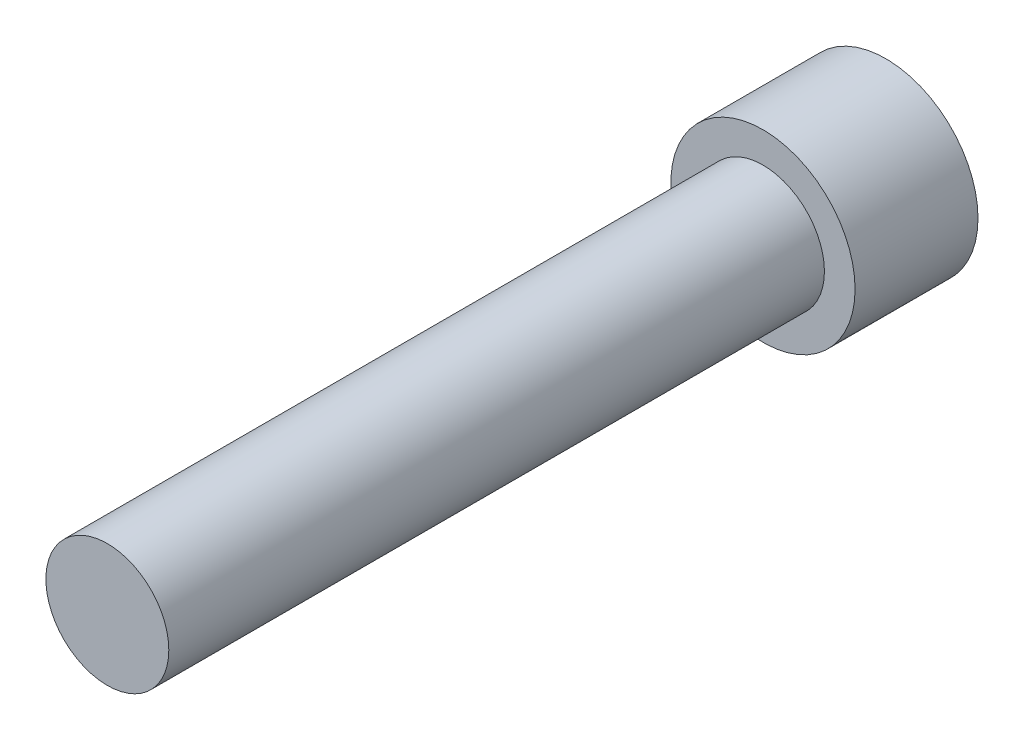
from build123d import *

# Parameters (mm, degrees)
HEX_2_DEPTH = 5.842


with BuildPart() as part:
    # Sketch6 → Revolve1 (revolve)
    with BuildSketch(Plane(origin=(0, 0, 0), x_dir=(0, 0, -1), z_dir=(1, 0, 0)), mode=Mode.PRIVATE) as revolve1_sk:
        Polygon((-50.8, 0), (-50.8, -4.7625), (0, -4.7625), (0, -7.1374), (9.525, -7.1374), (9.525, 0), align=None)
    revolve(revolve1_sk.sketch.rotate(Axis((0, 0, 50.8), (0, 0, -1)), 270), axis=Axis((0, 0, 50.8), (0, 0, -1)))

    # Sketch7 → HEX 2 (cut)
    with BuildSketch(Plane(origin=(0, 0, -9.525), x_dir=(-1, 0, 0), z_dir=(0, 0, -1))):
        Polygon((-3.9624, 2.287692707), (-3.9624, -2.287692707), (0, -4.575385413), (3.9624, -2.287692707), (3.9624, 2.287692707), (0, 4.575385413), align=None)
    extrude(amount=-HEX_2_DEPTH, mode=Mode.SUBTRACT)


solid = part.part
